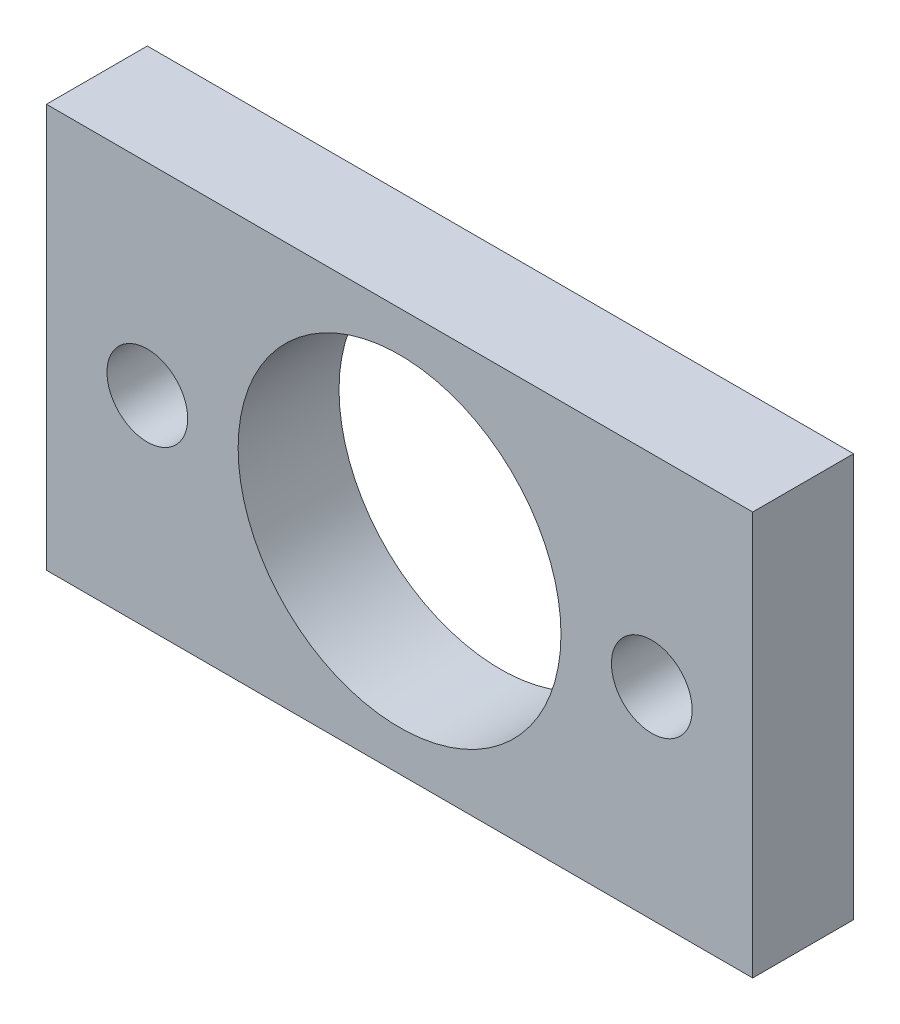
from build123d import *

# Parameters (mm, degrees)
CROQUIS1_W     = 70
CROQUIS1_H     = 40
CROQUIS1_R     = 16
CROQUIS1_R_2   = 4
EXTRUIR1_DEPTH = 10


with BuildPart() as part:
    # Croquis1 → Extruir1 (new body)
    with BuildSketch(Plane.XY):
        Rectangle(CROQUIS1_W, CROQUIS1_H)
        Circle(CROQUIS1_R, mode=Mode.SUBTRACT)
        with Locations((-25, 0)):
            Circle(CROQUIS1_R_2, mode=Mode.SUBTRACT)
        with Locations((25, 0)):
            Circle(CROQUIS1_R_2, mode=Mode.SUBTRACT)
    extrude(amount=EXTRUIR1_DEPTH)


solid = part.part
